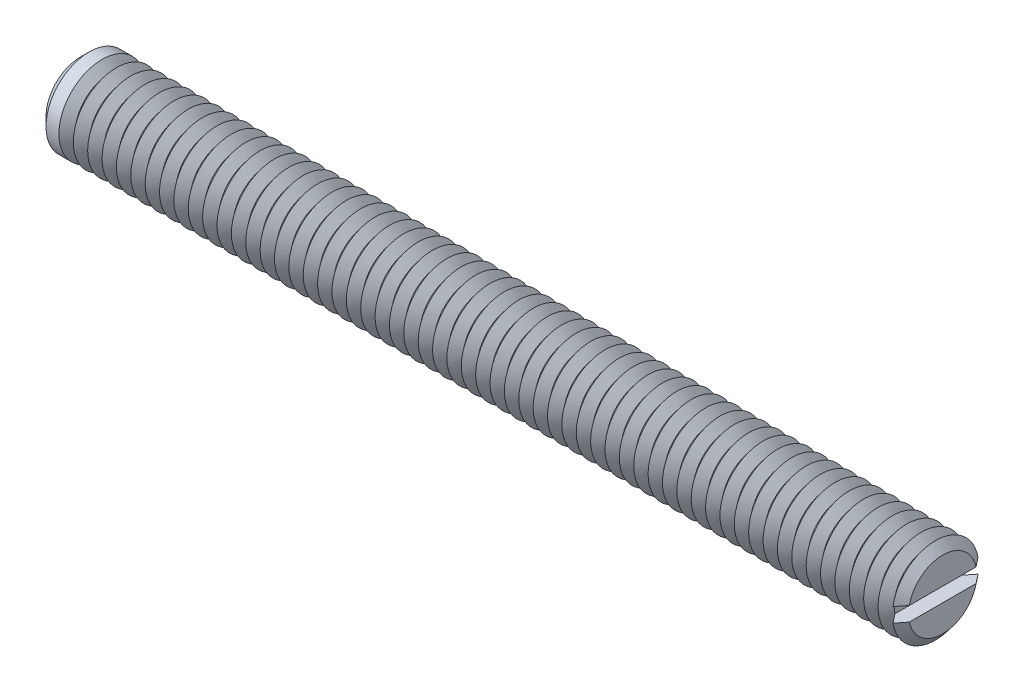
from build123d import *

# Parameters (mm, degrees)
SKETCH1_R       = 3
EXTRUDE1_DEPTH  = 30
SKETCH2_W       = 1
SKETCH2_H       = 1
EXTRUDE2_DEPTH  = 4.5
CHAMFER1_SIZE   = 0.6
LPATTERN1_COUNT = 59
LPATTERN1_PITCH = 1


with BuildPart() as part:
    # Sketch1 → Extrude1 (new, symmetric)
    with BuildSketch(Plane(origin=(0, 0, 0), x_dir=(0, 0, -1), z_dir=(1, 0, 0))):
        Circle(SKETCH1_R)
    extrude(amount=EXTRUDE1_DEPTH, both=True)

    # Sketch2 → Extrude2 (cut, symmetric)
    with BuildSketch(Plane.XY):
        with Locations((29.5, 0)):
            Rectangle(SKETCH2_W, SKETCH2_H)
    extrude(amount=EXTRUDE2_DEPTH, both=True, mode=Mode.SUBTRACT)

    # Chamfer1
    chamfer1_edges = [part.edges().sort_by_distance(p)[0] for p in [
        (-30, 0, 3),
    ]]
    chamfer(chamfer1_edges, length=CHAMFER1_SIZE)

    # Sketch3 → Cut-Revolve1 (revolve, cut)
    with BuildSketch(Plane.XY, mode=Mode.PRIVATE) as cut_revolve1_sk:
        Polygon((29.5, -3), (30.5, -3), (30, -2.3755002), align=None)
    cut_revolve1 = revolve(cut_revolve1_sk.sketch.rotate(Axis((0, 0, 0), (1, 0, 0)), 260.405931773), axis=Axis((0, 0, 0), (1, 0, 0)), mode=Mode.SUBTRACT)

    # LPattern1: Cut-Revolve1 ×59
    with Locations(*[(-i * LPATTERN1_PITCH, 0, 0) for i in range(1, LPATTERN1_COUNT)]):
        add(cut_revolve1, mode=Mode.SUBTRACT)


solid = part.part
